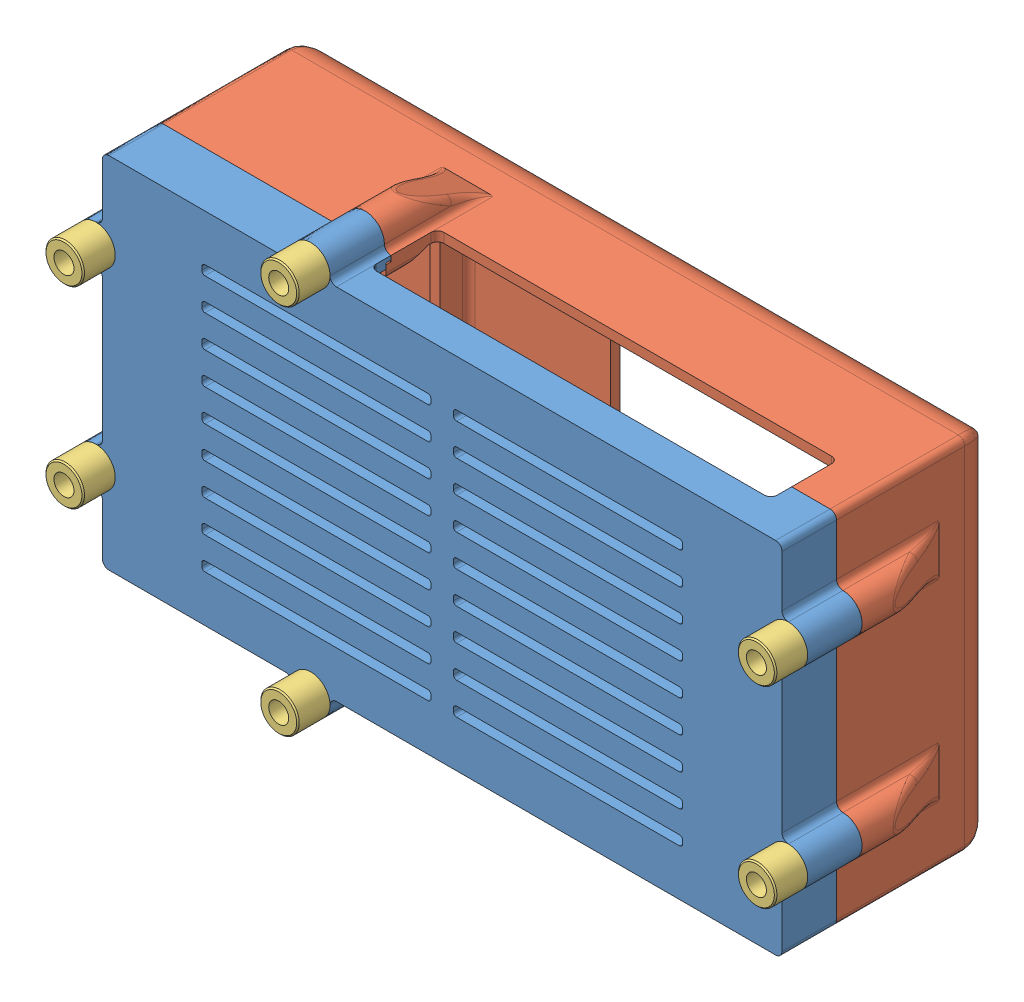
SolidWorks assembly carcasa.SLDASM, configuration Predeterminado (file format 10000). Lengths in mm.
Overall size (229.01 128 77).
8 component instances, 3 part files, 15 mates.
Components (placement in the parent):
- Base-1: Base.SLDPRT [Predeterminado] at origin size (228 128 17)
- Tapa-1: Tapa.SLDPRT [Predeterminado] at (0 0 -1.5) x (1 0 0) z (0 0 -1) size (228 128 51.5)
- Patas-1: Patas.SLDPRT [Predeterminado] at (108 -30 15.5) size (12 12 10)
- Patas-2: Patas.SLDPRT [Predeterminado] at (108 30 15.5) x (0.982585 0.185812 0) z (0 0 1) size (12 12 10)
- Patas-3: Patas.SLDPRT [Predeterminado] at (-108 30 15.5) size (12 12 10)
- Patas-4: Patas.SLDPRT [Predeterminado] at (-108 -30 15.5) size (12 12 10)
- Patas-5: Patas.SLDPRT [Predeterminado] at (-41 -58 15.5) size (12 12 10)
- Patas-6: Patas.SLDPRT [Predeterminado] at (-41 58 15.5) size (12 12 10)
Mates (geometry in assembly coordinates):
- Concéntrica1: concentric aligned: cylinder of Base-1 through (-108 -30 -1.501) axis (0 0 1) radius 1.6; cylinder of Tapa-1 through (-108 -30 -11.5) axis (0 0 1) radius 1.15
- Concéntrica2: concentric aligned: cylinder of Base-1 through (-108 30 -1.501) axis (0 0 1) radius 1.6; cylinder of Tapa-1 through (-108 30 -11.5) axis (0 0 1) radius 1.15
- Distancia límite1: limit distance anti-aligned: plane of Tapa-1 through (-101 -51 0) normal (0 0 1); plane of Base-1 through (108 -30 0) normal (0 0 -1)
- Coincidente1: coincident anti-aligned: plane of Base-1 through (108 -30 15.5) normal (0 0 1); plane of Patas-1 through (108 -30 15.5) normal (0 0 -1)
- Concéntrica3: concentric anti-aligned: cylinder of Base-1 through (108 -30 3) axis (0 0 1) radius 3.125; cylinder of Patas-1 through (108 -30 25.5) axis (0 0 -1) radius 3.125
- Concéntrica4: concentric anti-aligned: cylinder of Base-1 through (108 30 3) axis (0 0 1) radius 3.125; cylinder of Patas-2 through (108 30 25.5) axis (0 0 -1) radius 6
- Coincidente2: coincident anti-aligned: plane of Base-1 through (108 -30 15.5) normal (0 0 1); plane of Patas-2 through (108 30 15.5) normal (0 0 -1)
- Coincidente3: coincident anti-aligned: plane of Base-1 through (108 -30 15.5) normal (0 0 1); plane of Patas-4 through (-108 -30 15.5) normal (0 0 -1)
- Concéntrica5: concentric anti-aligned: cylinder of Base-1 through (-108 -30 3) axis (0 0 1) radius 3.125; cylinder of Patas-4 through (-108 -30 25.5) axis (0 0 -1) radius 3.125
- Coincidente4: coincident anti-aligned: plane of Base-1 through (108 -30 15.5) normal (0 0 1); plane of Patas-3 through (-108 30 15.5) normal (0 0 -1)
- Concéntrica6: concentric anti-aligned: cylinder of Base-1 through (-108 30 3) axis (0 0 1) radius 3.125; cylinder of Patas-3 through (-108 30 25.5) axis (0 0 -1) radius 3.125
- Coincidente5: coincident anti-aligned: plane of Base-1 through (108 -30 15.5) normal (0 0 1); plane of Patas-5 through (-41 -58 15.5) normal (0 0 -1)
- Concéntrica8: concentric anti-aligned: cylinder of Base-1 through (-41 -58 3) axis (0 0 1) radius 3.125; cylinder of Patas-5 through (-41 -58 25.5) axis (0 0 -1) radius 3.125
- Coincidente6: coincident anti-aligned: plane of Base-1 through (108 -30 15.5) normal (0 0 1); plane of Patas-6 through (-41 58 15.5) normal (0 0 -1)
- Concéntrica9: concentric anti-aligned: cylinder of Base-1 through (-41 58 3) axis (0 0 1) radius 3.125; cylinder of Patas-6 through (-41 58 25.5) axis (0 0 -1) radius 3.125
